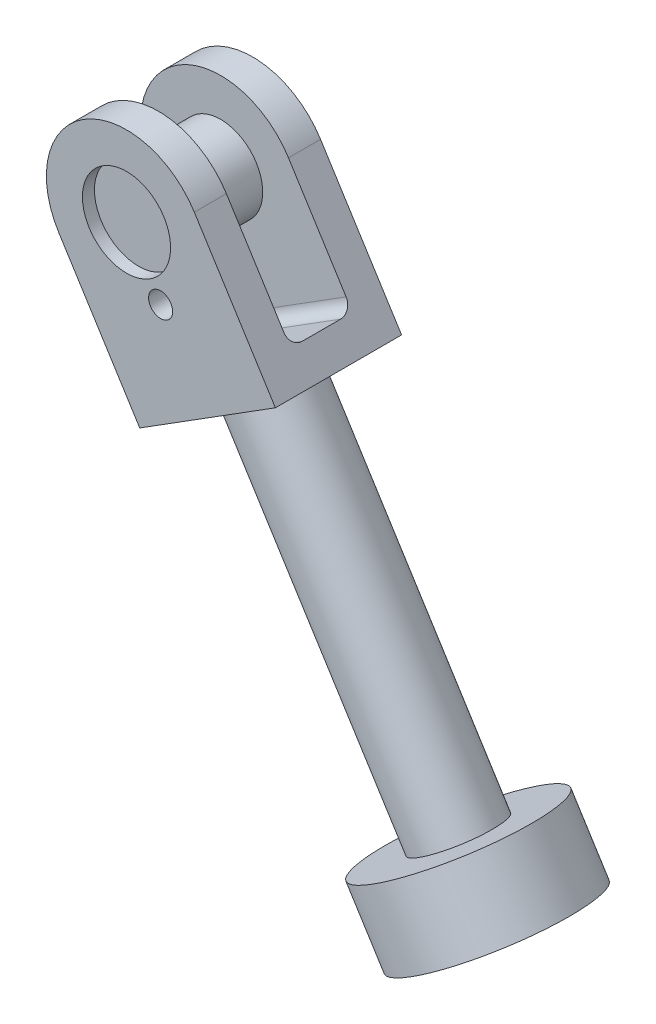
from build123d import *

# Parameters (mm, degrees)
SKETCH1_R                 = 11
BOSS_EXTRUDE1_DEPTH       = 7.75
BOSS_EXTRUDE1_2_DEPTH     = 7.75
BOSS_EXTRUDE2_DEPTH       = 8
BOSS_EXTRUDE3_START       = 8
BOSS_EXTRUDE3_DEPTH       = 8
CUT_EXTRUDE1_DEPTH        = 238.778258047
SKETCH5_W                 = 40
SKETCH5_H                 = 31.5
BOSS_EXTRUDE4_DEPTH       = 8
SKETCH6_W                 = 40
SKETCH6_H                 = 31.5
BOSS_EXTRUDE5_DEPTH       = 8
SKETCH7_R                 = 27.5
BOSS_EXTRUDE6_DEPTH       = 8
SKETCH8_R                 = 27.5
SKETCH8_R_2               = 21.5
BOSS_EXTRUDE7_DEPTH       = 85
SKETCH9_R                 = 10
BOSS_EXTRUDE8_DEPTH       = 100
SKETCH10_R                = 27.5
SKETCH10_R_2              = 10.125
BOSS_EXTRUDE9_DEPTH       = 6
BOSS_EXTRUDE10_DEPTH      = 6
BOSS_EXTRUDE10_DEPTH_BACK = 12
SKETCH11_R                = 21.5
CUT_EXTRUDE2_DEPTH        = 238.490657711
CUT_EXTRUDE2_DEPTH_BACK   = 238.490657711
SKETCH12_R                = 11
CUT_EXTRUDE3_REACH        = 240.608
SKETCH13_R                = 3
FILLET1_R                 = 3
SKETCH14_R                = 11
SKETCH14_R_2              = 10.5
BOSS_EXTRUDE11_DEPTH      = 5
SKETCH15_R                = 11
SKETCH15_R_2              = 10.5
BOSS_EXTRUDE12_DEPTH      = 5
SKETCH16_R                = 10.5
BOSS_EXTRUDE13_DEPTH      = 25.5


with BuildPart() as part:
    # Sketch1 → Boss-Extrude1 (new, symmetric)
    with BuildSketch(Plane.XY):
        with Locations((-86, 190.5)):
            Circle(SKETCH1_R)
    extrude(amount=BOSS_EXTRUDE1_DEPTH, both=True)



with BuildPart() as body_2:
    # Sketch1 → Boss-Extrude1 2 (new, symmetric)
    with BuildSketch(Plane.XY):
        with Locations((30.052173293, 5.946448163)):
            Circle(SKETCH1_R)
    extrude(amount=BOSS_EXTRUDE1_2_DEPTH, both=True)


with BuildPart() as part_1:
    add(part.part)

    add(body_2.part)  # Boss-Extrude2 merges body 2
    # Sketch2 → Boss-Extrude2 (add)
    with BuildSketch(Plane(origin=(0, 0, -7.75), x_dir=(-1, 0, 0), z_dir=(0, 0, -1))):
        with BuildLine():
            Line((-46.982957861, 16.592975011), (69.069215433, 201.146526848))
            ThreePointArc((69.069215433, 201.146526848), (96.646526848, 207.430784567), (102.930784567, 179.853473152))
            Line((102.930784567, 179.853473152), (-13.121388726, -4.700078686))
            ThreePointArc((-13.121388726, -4.700078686), (-40.698700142, -10.984336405), (-46.982957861, 16.592975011))
        make_face()
    extrude(amount=BOSS_EXTRUDE2_DEPTH)

    # Sketch3 → Boss-Extrude3 (add)
    with BuildSketch(Plane.XY.offset(7.75).offset(BOSS_EXTRUDE3_START)):
        with BuildLine():
            Line((46.982957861, 16.592975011), (-69.069215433, 201.146526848))
            ThreePointArc((-69.069215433, 201.146526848), (-96.646526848, 207.430784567), (-102.930784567, 179.853473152))
            Line((-102.930784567, 179.853473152), (13.121388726, -4.700078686))
            ThreePointArc((13.121388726, -4.700078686), (40.698700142, -10.984336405), (46.982957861, 16.592975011))
        make_face()
    extrude(amount=-BOSS_EXTRUDE3_DEPTH)

    # Sketch4 → Cut-Extrude1 (cut, through all)
    with BuildSketch(Plane.XY.offset(15.75)):
        Polygon((-53.09942516, 175.750349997), (-86.960994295, 154.457296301), (-2.848401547, 20.696098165), (31.013167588, 41.989151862), align=None)
    extrude(amount=-CUT_EXTRUDE1_DEPTH, mode=Mode.SUBTRACT)


with BuildPart() as cut_extrude1_piece_1:
    # of the separate pieces the step leaves, piece 1, a body of its own (cut_extrude1_pieces)
    add(part_1.part.solids().sort_by_distance((-2.848401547, 20.696098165, 15.75))[0])

    # Sketch6 → Boss-Extrude5 (add)
    with BuildSketch(Plane(origin=(-10.133544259, 16.115007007, 0), x_dir=(0.8465392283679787, 0.5323263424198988, 0), z_dir=(-0.5323263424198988, 0.8465392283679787, 0))):
        with Locations((28.605794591, 0)):
            Rectangle(SKETCH6_W, SKETCH6_H)
    extrude(amount=BOSS_EXTRUDE5_DEPTH)

    # Sketch7 → Boss-Extrude6 (add)
    with BuildSketch(Plane(origin=(-14.392154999, 22.887320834, 0), x_dir=(0.8465392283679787, 0.532326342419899, 0), z_dir=(-0.532326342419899, 0.8465392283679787, 0))):
        with Locations(Location((28.605794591, 0, 0), (0, 0, 180))):
            Circle(SKETCH7_R)
    extrude(amount=BOSS_EXTRUDE6_DEPTH)

    # Sketch8 → Boss-Extrude7 (add)
    with BuildSketch(Plane(origin=(-18.650765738, 29.659634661, 0), x_dir=(0.8465392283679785, 0.5323263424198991, 0), z_dir=(-0.5323263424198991, 0.8465392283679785, 0))):
        with Locations(Location((28.605794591, 0, 0), (0, 0, 180))):
            Circle(SKETCH8_R)
        with Locations(Location((28.605794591, 0, 0), (0, 0, 180))):
            Circle(SKETCH8_R_2, mode=Mode.SUBTRACT)
    extrude(amount=BOSS_EXTRUDE7_DEPTH)

    # Sketch10 → Boss-Extrude9 (add)
    with BuildSketch(Plane(origin=(-63.898504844, 101.615469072, 0), x_dir=(0.8465392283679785, 0.5323263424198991, 0), z_dir=(-0.5323263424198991, 0.8465392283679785, 0))):
        with Locations(Location((28.605794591, 0, 0), (0, 0, 180))):
            Circle(SKETCH10_R)
        with Locations(Location((28.605794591, 0, 0), (0, 0, 180))):
            Circle(SKETCH10_R_2, mode=Mode.SUBTRACT)
    extrude(amount=BOSS_EXTRUDE9_DEPTH)


with BuildPart() as cut_extrude1_piece_2:
    # of the separate pieces the step leaves, piece 2, a body of its own (cut_extrude1_pieces)
    add(part_1.part.solids().sort_by_distance((-102.930784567, 179.853473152, 15.75))[0])

    # Sketch5 → Boss-Extrude4 (add)
    with BuildSketch(Plane(origin=(-94.246137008, 149.876205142, 0), x_dir=(0.8465392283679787, 0.532326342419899, 0), z_dir=(0.532326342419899, -0.8465392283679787, 0))):
        with Locations((28.605794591, 0)):
            Rectangle(SKETCH5_W, SKETCH5_H)
    extrude(amount=BOSS_EXTRUDE4_DEPTH)

    # Sketch9 → Boss-Extrude8 (add)
    with BuildSketch(Plane(origin=(-89.987526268, 143.103891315, 0), x_dir=(0.8465392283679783, 0.5323263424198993, 0), z_dir=(0.5323263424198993, -0.8465392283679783, 0))):
        with Locations((28.605794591, 0)):
            Circle(SKETCH9_R)
    extrude(amount=BOSS_EXTRUDE8_DEPTH)


with BuildPart() as body_3:
    # Sketch11 → Boss-Extrude10 (new, two sides: drawn at the far end of the back side and taken through both)
    with BuildSketch(Plane(origin=(-36.754892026, 58.449968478, 0), x_dir=(0.8465392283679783, 0.5323263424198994, 0), z_dir=(0.5323263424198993, -0.8465392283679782, 0)).offset(-BOSS_EXTRUDE10_DEPTH_BACK)):
        with Locations(Location((28.605794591, 0, 0), (0, 0, 180))):
            Circle(SKETCH11_R)
    extrude(amount=BOSS_EXTRUDE10_DEPTH + BOSS_EXTRUDE10_DEPTH_BACK)

    # Combine1: union Cut-Extrude1 piece 2
    add(cut_extrude1_piece_2.part)

    # Sketch12 → Cut-Extrude2 (cut, two sides: drawn at the far end of the back side and taken through both)
    with BuildSketch(Plane(origin=(0, 0, 7.75), x_dir=(-1, 0, 0), z_dir=(0, 0, -1)).offset(-CUT_EXTRUDE2_DEPTH_BACK)):
        with Locations((86, 190.5)):
            Circle(SKETCH12_R)
    extrude(amount=CUT_EXTRUDE2_DEPTH + CUT_EXTRUDE2_DEPTH_BACK, mode=Mode.SUBTRACT)

    # Sketch13 → Cut-Extrude3 (cut, up to next)
    with BuildSketch(Plane.XY.offset(15.75), mode=Mode.PRIVATE) as cut_extrude3_sk1:
        with Locations((-77.482778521, 176.955372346)):
            Circle(SKETCH13_R)
    cut_extrude3_tool1 = extrude(cut_extrude3_sk1.sketch, amount=-CUT_EXTRUDE3_REACH, mode=Mode.PRIVATE) & body_3.part
    add(cut_extrude3_tool1.solids().sort_by_distance((-77.482779, 176.955372, 15.75))[0], mode=Mode.SUBTRACT)

    # Fillet1
    fillet1_edges = [body_3.edges().sort_by_distance(p)[0] for p in [
        (-70.030209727, 165.103823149, -7.75),
        (-70.030209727, 165.103823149, 7.75),
    ]]
    fillet(fillet1_edges, radius=FILLET1_R)

    # Sketch14 → Boss-Extrude11 (add)
    with BuildSketch(Plane.XY.offset(-7.75)):
        with Locations(Location((-86, 190.5, 0), (0, 0, 180))):
            Circle(SKETCH14_R)
        with Locations((-86, 190.5)):
            Circle(SKETCH14_R_2, mode=Mode.SUBTRACT)
    extrude(amount=-BOSS_EXTRUDE11_DEPTH)

    # Sketch15 → Boss-Extrude12 (add)
    with BuildSketch(Plane(origin=(0, 0, 7.75), x_dir=(-1, 0, 0), z_dir=(0, 0, -1))):
        with Locations((86, 190.5)):
            Circle(SKETCH15_R)
        with Locations(Location((86, 190.5, 0), (0, 0, 180))):
            Circle(SKETCH15_R_2, mode=Mode.SUBTRACT)
    extrude(amount=-BOSS_EXTRUDE12_DEPTH)

    # Sketch16 → Boss-Extrude13 (add)
    with BuildSketch(Plane(origin=(0, 0, -12.75), x_dir=(-1, 0, 0), z_dir=(0, 0, -1))):
        with Locations((86, 190.5)):
            Circle(SKETCH16_R)
    extrude(amount=-BOSS_EXTRUDE13_DEPTH)


solid = body_3.part
